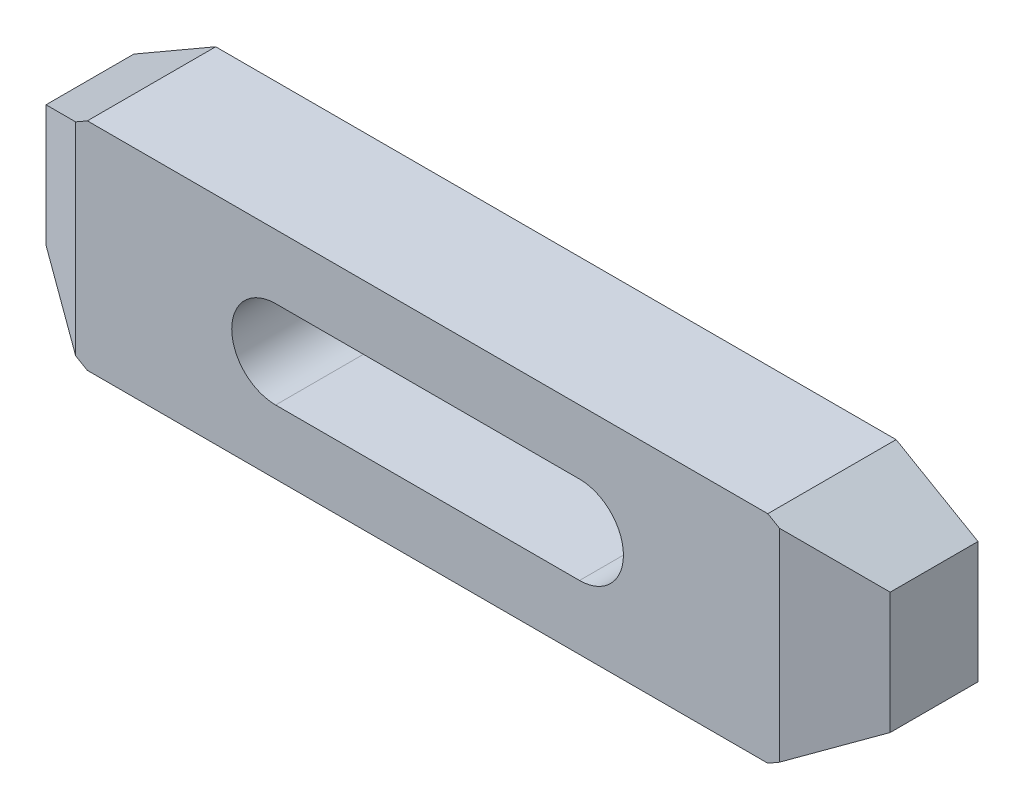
ISO-10303-21;
HEADER;
FILE_DESCRIPTION(('STEP AP214'),'2;1');
FILE_NAME('part.step','',(''),(''),'','','');
FILE_SCHEMA(('AUTOMOTIVE_DESIGN { 1 0 10303 214 1 1 1 1 }'));
ENDSEC;
DATA;
#1=APPLICATION_CONTEXT('core data for automotive mechanical design processes');
#2=APPLICATION_PROTOCOL_DEFINITION('international standard','automotive_design',2000,#1);
#3=PRODUCT_CONTEXT('',#1,'mechanical');
#4=PRODUCT('Part','Part','',(#3));
#5=PRODUCT_RELATED_PRODUCT_CATEGORY('part','',(#4));
#6=PRODUCT_DEFINITION_FORMATION('','',#4);
#7=PRODUCT_DEFINITION_CONTEXT('part definition',#1,'design');
#8=PRODUCT_DEFINITION('design','',#6,#7);
#9=PRODUCT_DEFINITION_SHAPE('','',#8);
#10=(LENGTH_UNIT() NAMED_UNIT(*) SI_UNIT(.MILLI.,.METRE.));
#11=(NAMED_UNIT(*) PLANE_ANGLE_UNIT() SI_UNIT($,.RADIAN.));
#12=(NAMED_UNIT(*) SI_UNIT($,.STERADIAN.) SOLID_ANGLE_UNIT());
#13=UNCERTAINTY_MEASURE_WITH_UNIT(LENGTH_MEASURE(1.E-05),#10,'distance_accuracy_value','');
#14=(GEOMETRIC_REPRESENTATION_CONTEXT(3) GLOBAL_UNCERTAINTY_ASSIGNED_CONTEXT((#13)) GLOBAL_UNIT_ASSIGNED_CONTEXT((#10,
#11,#12)) REPRESENTATION_CONTEXT('',''));
#15=CARTESIAN_POINT('',(0.,0.,0.));
#16=DIRECTION('',(0.,0.,1.));
#17=DIRECTION('',(1.,0.,0.));
#18=AXIS2_PLACEMENT_3D('',#15,#16,#17);
#19=CARTESIAN_POINT('',(0.,-45.0843918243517,19.));
#20=DIRECTION('',(0.,0.,-1.));
#21=DIRECTION('',(-1.,0.,0.));
#22=AXIS2_PLACEMENT_3D('',#19,#20,#21);
#23=PLANE('',#22);
#24=CARTESIAN_POINT('',(22.5,0.,19.));
#25=DIRECTION('',(0.,0.,1.));
#26=DIRECTION('',(1.,0.,0.));
#27=AXIS2_PLACEMENT_3D('',#24,#25,#26);
#28=CIRCLE('',#27,6.5);
#29=CARTESIAN_POINT('',(22.5,-6.5,19.));
#30=VERTEX_POINT('',#29);
#31=CARTESIAN_POINT('',(22.5,6.5,19.));
#32=VERTEX_POINT('',#31);
#33=EDGE_CURVE('E221',#30,#32,#28,.T.);
#34=ORIENTED_EDGE('',*,*,#33,.F.);
#35=DIRECTION('',(-1.,0.,0.));
#36=VECTOR('',#35,1.);
#37=CARTESIAN_POINT('',(22.5,-6.5,19.));
#38=LINE('',#37,#36);
#39=CARTESIAN_POINT('',(-22.5,-6.5,19.));
#40=VERTEX_POINT('',#39);
#41=EDGE_CURVE('E220',#30,#40,#38,.T.);
#42=ORIENTED_EDGE('',*,*,#41,.T.);
#43=CARTESIAN_POINT('',(-22.5,0.,19.));
#44=DIRECTION('',(0.,0.,1.));
#45=DIRECTION('',(1.,0.,0.));
#46=AXIS2_PLACEMENT_3D('',#43,#44,#45);
#47=CIRCLE('',#46,6.5);
#48=CARTESIAN_POINT('',(-22.5,6.5,19.));
#49=VERTEX_POINT('',#48);
#50=EDGE_CURVE('E228',#49,#40,#47,.T.);
#51=ORIENTED_EDGE('',*,*,#50,.F.);
#52=DIRECTION('',(-1.,0.,0.));
#53=VECTOR('',#52,1.);
#54=CARTESIAN_POINT('',(22.5,6.5,19.));
#55=LINE('',#54,#53);
#56=EDGE_CURVE('E224',#32,#49,#55,.T.);
#57=ORIENTED_EDGE('',*,*,#56,.F.);
#58=EDGE_LOOP('',(#34,#42,#51,#57));
#59=FACE_BOUND('',#58,.T.);
#60=DIRECTION('',(0.,1.,0.));
#61=VECTOR('',#60,1.);
#62=CARTESIAN_POINT('',(-52.1076951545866,-45.0843918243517,19.));
#63=LINE('',#62,#61);
#64=CARTESIAN_POINT('',(-52.1076951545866,-15.,19.));
#65=VERTEX_POINT('',#64);
#66=CARTESIAN_POINT('',(-52.1076951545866,15.,19.));
#67=VERTEX_POINT('',#66);
#68=EDGE_CURVE('E115',#65,#67,#63,.T.);
#69=ORIENTED_EDGE('',*,*,#68,.F.);
#70=DIRECTION('',(-0.866025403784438,0.5,0.));
#71=VECTOR('',#70,1.);
#72=CARTESIAN_POINT('',(-50.3756443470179,-16.,19.));
#73=LINE('',#72,#71);
#74=CARTESIAN_POINT('',(-50.3756443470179,-16.,19.));
#75=VERTEX_POINT('',#74);
#76=EDGE_CURVE('E174',#75,#65,#73,.T.);
#77=ORIENTED_EDGE('',*,*,#76,.F.);
#78=DIRECTION('',(-1.,0.,0.));
#79=VECTOR('',#78,1.);
#80=CARTESIAN_POINT('',(50.3756443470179,-16.,19.));
#81=LINE('',#80,#79);
#82=CARTESIAN_POINT('',(50.3756443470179,-16.,19.));
#83=VERTEX_POINT('',#82);
#84=EDGE_CURVE('E177',#83,#75,#81,.T.);
#85=ORIENTED_EDGE('',*,*,#84,.F.);
#86=DIRECTION('',(-0.866025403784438,-0.5,0.));
#87=VECTOR('',#86,1.);
#88=CARTESIAN_POINT('',(62.5,-9.,19.));
#89=LINE('',#88,#87);
#90=CARTESIAN_POINT('',(52.1076951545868,-15.,19.));
#91=VERTEX_POINT('',#90);
#92=EDGE_CURVE('E157',#91,#83,#89,.T.);
#93=ORIENTED_EDGE('',*,*,#92,.F.);
#94=DIRECTION('',(0.,1.,0.));
#95=VECTOR('',#94,1.);
#96=CARTESIAN_POINT('',(52.1076951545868,-45.0843918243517,19.));
#97=LINE('',#96,#95);
#98=CARTESIAN_POINT('',(52.1076951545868,15.,19.));
#99=VERTEX_POINT('',#98);
#100=EDGE_CURVE('E146',#91,#99,#97,.T.);
#101=ORIENTED_EDGE('',*,*,#100,.T.);
#102=DIRECTION('',(0.866025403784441,-0.5,0.));
#103=VECTOR('',#102,1.);
#104=CARTESIAN_POINT('',(50.3756443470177,16.,19.));
#105=LINE('',#104,#103);
#106=CARTESIAN_POINT('',(50.3756443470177,16.,19.));
#107=VERTEX_POINT('',#106);
#108=EDGE_CURVE('E155',#107,#99,#105,.T.);
#109=ORIENTED_EDGE('',*,*,#108,.F.);
#110=DIRECTION('',(1.,0.,0.));
#111=VECTOR('',#110,1.);
#112=CARTESIAN_POINT('',(-50.3756443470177,16.,19.));
#113=LINE('',#112,#111);
#114=CARTESIAN_POINT('',(-50.3756443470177,16.,19.));
#115=VERTEX_POINT('',#114);
#116=EDGE_CURVE('E164',#115,#107,#113,.T.);
#117=ORIENTED_EDGE('',*,*,#116,.F.);
#118=DIRECTION('',(0.866025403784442,0.5,0.));
#119=VECTOR('',#118,1.);
#120=CARTESIAN_POINT('',(-62.5,9.,19.));
#121=LINE('',#120,#119);
#122=EDGE_CURVE('E167',#67,#115,#121,.T.);
#123=ORIENTED_EDGE('',*,*,#122,.F.);
#124=EDGE_LOOP('',(#69,#77,#85,#93,#101,#109,#117,#123));
#125=FACE_BOUND('',#124,.T.);
#126=ADVANCED_FACE('F14',(#59,#125),#23,.F.);
#127=CARTESIAN_POINT('',(-62.5,9.,19.));
#128=DIRECTION('',(-0.5,0.866025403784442,0.));
#129=DIRECTION('',(-0.866025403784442,-0.5,0.));
#130=AXIS2_PLACEMENT_3D('',#127,#128,#129);
#131=PLANE('',#130);
#132=DIRECTION('',(0.,0.,-1.));
#133=VECTOR('',#132,1.);
#134=CARTESIAN_POINT('',(-62.5,9.,19.));
#135=LINE('',#134,#133);
#136=CARTESIAN_POINT('',(-62.5,9.,13.));
#137=VERTEX_POINT('',#136);
#138=CARTESIAN_POINT('',(-62.5,9.,0.));
#139=VERTEX_POINT('',#138);
#140=EDGE_CURVE('E124',#137,#139,#135,.T.);
#141=ORIENTED_EDGE('',*,*,#140,.F.);
#142=DIRECTION('',(0.774596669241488,0.447213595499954,0.447213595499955));
#143=VECTOR('',#142,1.);
#144=CARTESIAN_POINT('',(-60.4215390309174,10.2,14.2));
#145=LINE('',#144,#143);
#146=EDGE_CURVE('E112',#137,#67,#145,.T.);
#147=ORIENTED_EDGE('',*,*,#146,.T.);
#148=ORIENTED_EDGE('',*,*,#122,.T.);
#149=DIRECTION('',(0.,0.,-1.));
#150=VECTOR('',#149,1.);
#151=CARTESIAN_POINT('',(-50.3756443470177,16.,19.));
#152=LINE('',#151,#150);
#153=CARTESIAN_POINT('',(-50.3756443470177,16.,0.));
#154=VERTEX_POINT('',#153);
#155=EDGE_CURVE('E132',#115,#154,#152,.T.);
#156=ORIENTED_EDGE('',*,*,#155,.T.);
#157=DIRECTION('',(0.866025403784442,0.5,0.));
#158=VECTOR('',#157,1.);
#159=CARTESIAN_POINT('',(-62.5,9.,0.));
#160=LINE('',#159,#158);
#161=EDGE_CURVE('E131',#139,#154,#160,.T.);
#162=ORIENTED_EDGE('',*,*,#161,.F.);
#163=EDGE_LOOP('',(#141,#147,#148,#156,#162));
#164=FACE_BOUND('',#163,.T.);
#165=ADVANCED_FACE('F129',(#164),#131,.T.);
#166=CARTESIAN_POINT('',(-62.5,-9.,19.));
#167=DIRECTION('',(-1.,0.,0.));
#168=DIRECTION('',(0.,0.,1.));
#169=AXIS2_PLACEMENT_3D('',#166,#167,#168);
#170=PLANE('',#169);
#171=DIRECTION('',(0.,0.,-1.));
#172=VECTOR('',#171,1.);
#173=CARTESIAN_POINT('',(-62.5,-9.,19.));
#174=LINE('',#173,#172);
#175=CARTESIAN_POINT('',(-62.5,-9.,13.));
#176=VERTEX_POINT('',#175);
#177=CARTESIAN_POINT('',(-62.5,-9.,0.));
#178=VERTEX_POINT('',#177);
#179=EDGE_CURVE('E126',#176,#178,#174,.T.);
#180=ORIENTED_EDGE('',*,*,#179,.F.);
#181=DIRECTION('',(0.,1.,0.));
#182=VECTOR('',#181,1.);
#183=CARTESIAN_POINT('',(-62.5,-20.,13.));
#184=LINE('',#183,#182);
#185=EDGE_CURVE('E29',#176,#137,#184,.T.);
#186=ORIENTED_EDGE('',*,*,#185,.T.);
#187=ORIENTED_EDGE('',*,*,#140,.T.);
#188=DIRECTION('',(0.,1.,0.));
#189=VECTOR('',#188,1.);
#190=CARTESIAN_POINT('',(-62.5,-9.,0.));
#191=LINE('',#190,#189);
#192=EDGE_CURVE('E199',#178,#139,#191,.T.);
#193=ORIENTED_EDGE('',*,*,#192,.F.);
#194=EDGE_LOOP('',(#180,#186,#187,#193));
#195=FACE_BOUND('',#194,.T.);
#196=ADVANCED_FACE('F122',(#195),#170,.T.);
#197=CARTESIAN_POINT('',(-50.3756443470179,-16.,19.));
#198=DIRECTION('',(-0.5,-0.866025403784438,0.));
#199=DIRECTION('',(0.866025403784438,-0.5,0.));
#200=AXIS2_PLACEMENT_3D('',#197,#198,#199);
#201=PLANE('',#200);
#202=ORIENTED_EDGE('',*,*,#76,.T.);
#203=DIRECTION('',(-0.774596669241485,0.44721359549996,-0.447213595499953));
#204=VECTOR('',#203,1.);
#205=CARTESIAN_POINT('',(-50.7220545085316,-15.8,19.8));
#206=LINE('',#205,#204);
#207=EDGE_CURVE('E9',#65,#176,#206,.T.);
#208=ORIENTED_EDGE('',*,*,#207,.T.);
#209=ORIENTED_EDGE('',*,*,#179,.T.);
#210=DIRECTION('',(-0.866025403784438,0.5,0.));
#211=VECTOR('',#210,1.);
#212=CARTESIAN_POINT('',(-50.3756443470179,-16.,0.));
#213=LINE('',#212,#211);
#214=CARTESIAN_POINT('',(-50.3756443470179,-16.,0.));
#215=VERTEX_POINT('',#214);
#216=EDGE_CURVE('E195',#215,#178,#213,.T.);
#217=ORIENTED_EDGE('',*,*,#216,.F.);
#218=DIRECTION('',(0.,0.,-1.));
#219=VECTOR('',#218,1.);
#220=CARTESIAN_POINT('',(-50.3756443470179,-16.,19.));
#221=LINE('',#220,#219);
#222=EDGE_CURVE('E136',#75,#215,#221,.T.);
#223=ORIENTED_EDGE('',*,*,#222,.F.);
#224=EDGE_LOOP('',(#202,#208,#209,#217,#223));
#225=FACE_BOUND('',#224,.T.);
#226=ADVANCED_FACE('F198',(#225),#201,.T.);
#227=CARTESIAN_POINT('',(0.,-45.0843918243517,0.));
#228=DIRECTION('',(0.,0.,-1.));
#229=DIRECTION('',(-1.,0.,0.));
#230=AXIS2_PLACEMENT_3D('',#227,#228,#229);
#231=PLANE('',#230);
#232=DIRECTION('',(-0.866025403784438,-0.5,0.));
#233=VECTOR('',#232,1.);
#234=CARTESIAN_POINT('',(62.5,-9.,0.));
#235=LINE('',#234,#233);
#236=CARTESIAN_POINT('',(62.5,-9.,0.));
#237=VERTEX_POINT('',#236);
#238=CARTESIAN_POINT('',(50.3756443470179,-16.,0.));
#239=VERTEX_POINT('',#238);
#240=EDGE_CURVE('E170',#237,#239,#235,.T.);
#241=ORIENTED_EDGE('',*,*,#240,.T.);
#242=DIRECTION('',(-1.,0.,0.));
#243=VECTOR('',#242,1.);
#244=CARTESIAN_POINT('',(50.3756443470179,-16.,0.));
#245=LINE('',#244,#243);
#246=EDGE_CURVE('E186',#239,#215,#245,.T.);
#247=ORIENTED_EDGE('',*,*,#246,.T.);
#248=ORIENTED_EDGE('',*,*,#216,.T.);
#249=ORIENTED_EDGE('',*,*,#192,.T.);
#250=ORIENTED_EDGE('',*,*,#161,.T.);
#251=DIRECTION('',(1.,0.,0.));
#252=VECTOR('',#251,1.);
#253=CARTESIAN_POINT('',(-50.3756443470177,16.,0.));
#254=LINE('',#253,#252);
#255=CARTESIAN_POINT('',(50.3756443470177,16.,0.));
#256=VERTEX_POINT('',#255);
#257=EDGE_CURVE('E204',#154,#256,#254,.T.);
#258=ORIENTED_EDGE('',*,*,#257,.T.);
#259=DIRECTION('',(0.866025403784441,-0.5,0.));
#260=VECTOR('',#259,1.);
#261=CARTESIAN_POINT('',(50.3756443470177,16.,0.));
#262=LINE('',#261,#260);
#263=CARTESIAN_POINT('',(62.5,9.,0.));
#264=VERTEX_POINT('',#263);
#265=EDGE_CURVE('E207',#256,#264,#262,.T.);
#266=ORIENTED_EDGE('',*,*,#265,.T.);
#267=DIRECTION('',(0.,-1.,0.));
#268=VECTOR('',#267,1.);
#269=CARTESIAN_POINT('',(62.5,9.,0.));
#270=LINE('',#269,#268);
#271=EDGE_CURVE('E180',#264,#237,#270,.T.);
#272=ORIENTED_EDGE('',*,*,#271,.T.);
#273=EDGE_LOOP('',(#241,#247,#248,#249,#250,#258,#266,#272));
#274=FACE_BOUND('',#273,.T.);
#275=DIRECTION('',(-1.,0.,0.));
#276=VECTOR('',#275,1.);
#277=CARTESIAN_POINT('',(22.5,-6.5,0.));
#278=LINE('',#277,#276);
#279=CARTESIAN_POINT('',(22.5,-6.5,0.));
#280=VERTEX_POINT('',#279);
#281=CARTESIAN_POINT('',(-22.5,-6.5,0.));
#282=VERTEX_POINT('',#281);
#283=EDGE_CURVE('E225',#280,#282,#278,.T.);
#284=ORIENTED_EDGE('',*,*,#283,.F.);
#285=CARTESIAN_POINT('',(22.5,0.,0.));
#286=DIRECTION('',(0.,0.,1.));
#287=DIRECTION('',(1.,0.,0.));
#288=AXIS2_PLACEMENT_3D('',#285,#286,#287);
#289=CIRCLE('',#288,6.5);
#290=CARTESIAN_POINT('',(22.5,6.5,0.));
#291=VERTEX_POINT('',#290);
#292=EDGE_CURVE('E232',#280,#291,#289,.T.);
#293=ORIENTED_EDGE('',*,*,#292,.T.);
#294=DIRECTION('',(-1.,0.,0.));
#295=VECTOR('',#294,1.);
#296=CARTESIAN_POINT('',(22.5,6.5,0.));
#297=LINE('',#296,#295);
#298=CARTESIAN_POINT('',(-22.5,6.5,0.));
#299=VERTEX_POINT('',#298);
#300=EDGE_CURVE('E235',#291,#299,#297,.T.);
#301=ORIENTED_EDGE('',*,*,#300,.T.);
#302=CARTESIAN_POINT('',(-22.5,0.,0.));
#303=DIRECTION('',(0.,0.,1.));
#304=DIRECTION('',(1.,0.,0.));
#305=AXIS2_PLACEMENT_3D('',#302,#303,#304);
#306=CIRCLE('',#305,6.5);
#307=EDGE_CURVE('E238',#299,#282,#306,.T.);
#308=ORIENTED_EDGE('',*,*,#307,.T.);
#309=EDGE_LOOP('',(#284,#293,#301,#308));
#310=FACE_BOUND('',#309,.T.);
#311=ADVANCED_FACE('F193',(#274,#310),#231,.T.);
#312=CARTESIAN_POINT('',(62.5,-9.,19.));
#313=DIRECTION('',(0.5,-0.866025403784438,0.));
#314=DIRECTION('',(0.866025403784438,0.5,0.));
#315=AXIS2_PLACEMENT_3D('',#312,#313,#314);
#316=PLANE('',#315);
#317=DIRECTION('',(0.774596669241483,0.447213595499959,-0.447213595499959));
#318=VECTOR('',#317,1.);
#319=CARTESIAN_POINT('',(60.4215390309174,-10.2,14.2));
#320=LINE('',#319,#318);
#321=CARTESIAN_POINT('',(62.5,-9.,13.));
#322=VERTEX_POINT('',#321);
#323=EDGE_CURVE('E158',#91,#322,#320,.T.);
#324=ORIENTED_EDGE('',*,*,#323,.F.);
#325=ORIENTED_EDGE('',*,*,#92,.T.);
#326=DIRECTION('',(0.,0.,-1.));
#327=VECTOR('',#326,1.);
#328=CARTESIAN_POINT('',(50.3756443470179,-16.,19.));
#329=LINE('',#328,#327);
#330=EDGE_CURVE('E163',#83,#239,#329,.T.);
#331=ORIENTED_EDGE('',*,*,#330,.T.);
#332=ORIENTED_EDGE('',*,*,#240,.F.);
#333=DIRECTION('',(0.,0.,-1.));
#334=VECTOR('',#333,1.);
#335=CARTESIAN_POINT('',(62.5,-9.,19.));
#336=LINE('',#335,#334);
#337=EDGE_CURVE('E143',#322,#237,#336,.T.);
#338=ORIENTED_EDGE('',*,*,#337,.F.);
#339=EDGE_LOOP('',(#324,#325,#331,#332,#338));
#340=FACE_BOUND('',#339,.T.);
#341=ADVANCED_FACE('F249',(#340),#316,.T.);
#342=CARTESIAN_POINT('',(62.5,9.,19.));
#343=DIRECTION('',(1.,0.,0.));
#344=DIRECTION('',(0.,0.,-1.));
#345=AXIS2_PLACEMENT_3D('',#342,#343,#344);
#346=PLANE('',#345);
#347=DIRECTION('',(0.,1.,0.));
#348=VECTOR('',#347,1.);
#349=CARTESIAN_POINT('',(62.5,-20.,13.));
#350=LINE('',#349,#348);
#351=CARTESIAN_POINT('',(62.5,9.,13.));
#352=VERTEX_POINT('',#351);
#353=EDGE_CURVE('E36',#322,#352,#350,.T.);
#354=ORIENTED_EDGE('',*,*,#353,.F.);
#355=ORIENTED_EDGE('',*,*,#337,.T.);
#356=ORIENTED_EDGE('',*,*,#271,.F.);
#357=DIRECTION('',(0.,0.,-1.));
#358=VECTOR('',#357,1.);
#359=CARTESIAN_POINT('',(62.5,9.,19.));
#360=LINE('',#359,#358);
#361=EDGE_CURVE('E141',#352,#264,#360,.T.);
#362=ORIENTED_EDGE('',*,*,#361,.F.);
#363=EDGE_LOOP('',(#354,#355,#356,#362));
#364=FACE_BOUND('',#363,.T.);
#365=ADVANCED_FACE('F16',(#364),#346,.T.);
#366=CARTESIAN_POINT('',(50.3756443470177,16.,19.));
#367=DIRECTION('',(0.5,0.866025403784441,0.));
#368=DIRECTION('',(-0.866025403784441,0.5,0.));
#369=AXIS2_PLACEMENT_3D('',#366,#367,#368);
#370=PLANE('',#369);
#371=DIRECTION('',(-0.774596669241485,0.447213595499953,0.44721359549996));
#372=VECTOR('',#371,1.);
#373=CARTESIAN_POINT('',(50.7220545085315,15.8,19.8));
#374=LINE('',#373,#372);
#375=EDGE_CURVE('E22',#352,#99,#374,.T.);
#376=ORIENTED_EDGE('',*,*,#375,.F.);
#377=ORIENTED_EDGE('',*,*,#361,.T.);
#378=ORIENTED_EDGE('',*,*,#265,.F.);
#379=DIRECTION('',(0.,0.,-1.));
#380=VECTOR('',#379,1.);
#381=CARTESIAN_POINT('',(50.3756443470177,16.,19.));
#382=LINE('',#381,#380);
#383=EDGE_CURVE('E134',#107,#256,#382,.T.);
#384=ORIENTED_EDGE('',*,*,#383,.F.);
#385=ORIENTED_EDGE('',*,*,#108,.T.);
#386=EDGE_LOOP('',(#376,#377,#378,#384,#385));
#387=FACE_BOUND('',#386,.T.);
#388=ADVANCED_FACE('F160',(#387),#370,.T.);
#389=CARTESIAN_POINT('',(-50.3756443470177,16.,19.));
#390=DIRECTION('',(0.,1.,0.));
#391=DIRECTION('',(-1.,0.,0.));
#392=AXIS2_PLACEMENT_3D('',#389,#390,#391);
#393=PLANE('',#392);
#394=ORIENTED_EDGE('',*,*,#155,.F.);
#395=ORIENTED_EDGE('',*,*,#116,.T.);
#396=ORIENTED_EDGE('',*,*,#383,.T.);
#397=ORIENTED_EDGE('',*,*,#257,.F.);
#398=EDGE_LOOP('',(#394,#395,#396,#397));
#399=FACE_BOUND('',#398,.T.);
#400=ADVANCED_FACE('F253',(#399),#393,.T.);
#401=CARTESIAN_POINT('',(50.3756443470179,-16.,19.));
#402=DIRECTION('',(0.,-1.,0.));
#403=DIRECTION('',(1.,0.,0.));
#404=AXIS2_PLACEMENT_3D('',#401,#402,#403);
#405=PLANE('',#404);
#406=ORIENTED_EDGE('',*,*,#84,.T.);
#407=ORIENTED_EDGE('',*,*,#222,.T.);
#408=ORIENTED_EDGE('',*,*,#246,.F.);
#409=ORIENTED_EDGE('',*,*,#330,.F.);
#410=EDGE_LOOP('',(#406,#407,#408,#409));
#411=FACE_BOUND('',#410,.T.);
#412=ADVANCED_FACE('F184',(#411),#405,.T.);
#413=CARTESIAN_POINT('',(22.5,0.,19.));
#414=DIRECTION('',(0.,0.,-1.));
#415=DIRECTION('',(-1.,0.,0.));
#416=AXIS2_PLACEMENT_3D('',#413,#414,#415);
#417=CYLINDRICAL_SURFACE('',#416,6.5);
#418=DIRECTION('',(0.,0.,-1.));
#419=VECTOR('',#418,1.);
#420=CARTESIAN_POINT('',(22.5,6.5,19.));
#421=LINE('',#420,#419);
#422=EDGE_CURVE('E211',#32,#291,#421,.T.);
#423=ORIENTED_EDGE('',*,*,#422,.T.);
#424=ORIENTED_EDGE('',*,*,#292,.F.);
#425=DIRECTION('',(0.,0.,-1.));
#426=VECTOR('',#425,1.);
#427=CARTESIAN_POINT('',(22.5,-6.5,19.));
#428=LINE('',#427,#426);
#429=EDGE_CURVE('E217',#30,#280,#428,.T.);
#430=ORIENTED_EDGE('',*,*,#429,.F.);
#431=ORIENTED_EDGE('',*,*,#33,.T.);
#432=EDGE_LOOP('',(#423,#424,#430,#431));
#433=FACE_BOUND('',#432,.T.);
#434=ADVANCED_FACE('F261',(#433),#417,.F.);
#435=CARTESIAN_POINT('',(22.5,6.5,19.));
#436=DIRECTION('',(0.,-1.,0.));
#437=DIRECTION('',(1.,0.,0.));
#438=AXIS2_PLACEMENT_3D('',#435,#436,#437);
#439=PLANE('',#438);
#440=DIRECTION('',(0.,0.,-1.));
#441=VECTOR('',#440,1.);
#442=CARTESIAN_POINT('',(-22.5,6.5,19.));
#443=LINE('',#442,#441);
#444=EDGE_CURVE('E213',#49,#299,#443,.T.);
#445=ORIENTED_EDGE('',*,*,#444,.T.);
#446=ORIENTED_EDGE('',*,*,#300,.F.);
#447=ORIENTED_EDGE('',*,*,#422,.F.);
#448=ORIENTED_EDGE('',*,*,#56,.T.);
#449=EDGE_LOOP('',(#445,#446,#447,#448));
#450=FACE_BOUND('',#449,.T.);
#451=ADVANCED_FACE('F336',(#450),#439,.T.);
#452=CARTESIAN_POINT('',(-22.5,0.,19.));
#453=DIRECTION('',(0.,0.,-1.));
#454=DIRECTION('',(-1.,0.,0.));
#455=AXIS2_PLACEMENT_3D('',#452,#453,#454);
#456=CYLINDRICAL_SURFACE('',#455,6.5);
#457=DIRECTION('',(0.,0.,-1.));
#458=VECTOR('',#457,1.);
#459=CARTESIAN_POINT('',(-22.5,-6.5,19.));
#460=LINE('',#459,#458);
#461=EDGE_CURVE('E215',#40,#282,#460,.T.);
#462=ORIENTED_EDGE('',*,*,#461,.T.);
#463=ORIENTED_EDGE('',*,*,#307,.F.);
#464=ORIENTED_EDGE('',*,*,#444,.F.);
#465=ORIENTED_EDGE('',*,*,#50,.T.);
#466=EDGE_LOOP('',(#462,#463,#464,#465));
#467=FACE_BOUND('',#466,.T.);
#468=ADVANCED_FACE('F346',(#467),#456,.F.);
#469=CARTESIAN_POINT('',(22.5,-6.5,19.));
#470=DIRECTION('',(0.,-1.,0.));
#471=DIRECTION('',(1.,0.,0.));
#472=AXIS2_PLACEMENT_3D('',#469,#470,#471);
#473=PLANE('',#472);
#474=ORIENTED_EDGE('',*,*,#41,.F.);
#475=ORIENTED_EDGE('',*,*,#429,.T.);
#476=ORIENTED_EDGE('',*,*,#283,.T.);
#477=ORIENTED_EDGE('',*,*,#461,.F.);
#478=EDGE_LOOP('',(#474,#475,#476,#477));
#479=FACE_BOUND('',#478,.T.);
#480=ADVANCED_FACE('F355',(#479),#473,.F.);
#481=CARTESIAN_POINT('',(62.5,-20.,13.));
#482=DIRECTION('',(-0.5,0.,-0.866025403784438));
#483=DIRECTION('',(-0.866025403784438,0.,0.5));
#484=AXIS2_PLACEMENT_3D('',#481,#482,#483);
#485=PLANE('',#484);
#486=ORIENTED_EDGE('',*,*,#323,.T.);
#487=ORIENTED_EDGE('',*,*,#353,.T.);
#488=ORIENTED_EDGE('',*,*,#375,.T.);
#489=ORIENTED_EDGE('',*,*,#100,.F.);
#490=EDGE_LOOP('',(#486,#487,#488,#489));
#491=FACE_BOUND('',#490,.T.);
#492=ADVANCED_FACE('F145',(#491),#485,.F.);
#493=CARTESIAN_POINT('',(-62.5,-20.,13.));
#494=DIRECTION('',(-0.5,0.,0.866025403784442));
#495=DIRECTION('',(0.866025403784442,0.,0.5));
#496=AXIS2_PLACEMENT_3D('',#493,#494,#495);
#497=PLANE('',#496);
#498=ORIENTED_EDGE('',*,*,#185,.F.);
#499=ORIENTED_EDGE('',*,*,#207,.F.);
#500=ORIENTED_EDGE('',*,*,#68,.T.);
#501=ORIENTED_EDGE('',*,*,#146,.F.);
#502=EDGE_LOOP('',(#498,#499,#500,#501));
#503=FACE_BOUND('',#502,.T.);
#504=ADVANCED_FACE('F113',(#503),#497,.T.);
#505=CLOSED_SHELL('',(#126,#165,#196,#226,#311,#341,#365,#388,#400,#412,#434,#451,#468,#480,
#492,#504));
#506=MANIFOLD_SOLID_BREP('B1',#505);
#507=ADVANCED_BREP_SHAPE_REPRESENTATION('',(#18,#506),#14);
#508=SHAPE_DEFINITION_REPRESENTATION(#9,#507);
ENDSEC;
END-ISO-10303-21;
